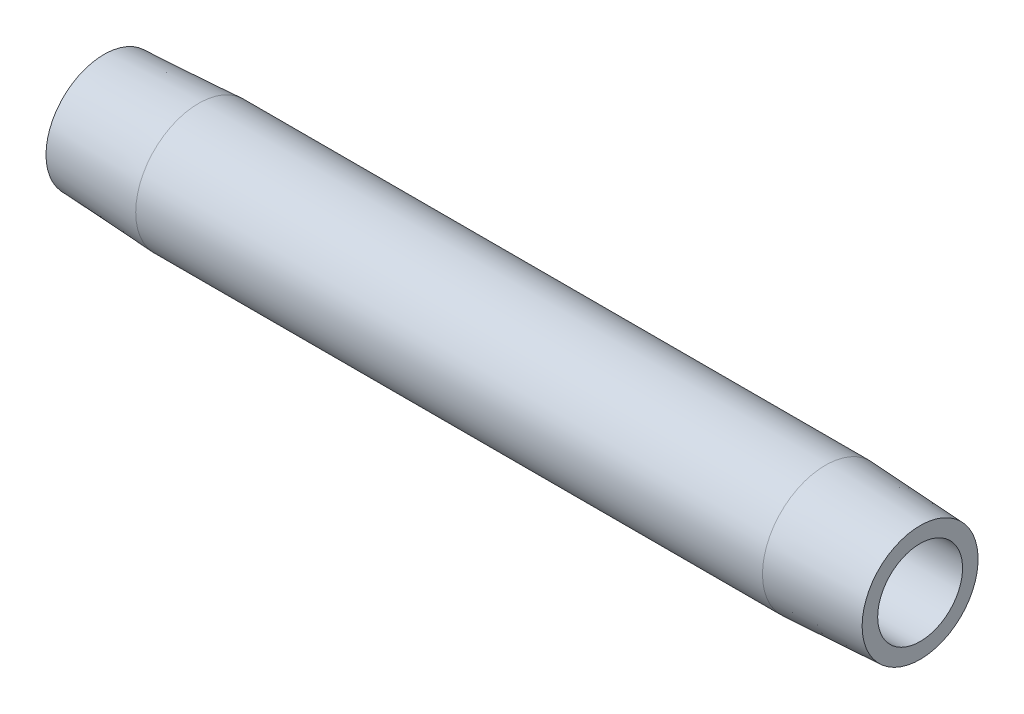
ISO-10303-21;
HEADER;
FILE_DESCRIPTION(('STEP AP214'),'2;1');
FILE_NAME('part.step','',(''),(''),'','','');
FILE_SCHEMA(('AUTOMOTIVE_DESIGN { 1 0 10303 214 1 1 1 1 }'));
ENDSEC;
DATA;
#1=APPLICATION_CONTEXT('core data for automotive mechanical design processes');
#2=APPLICATION_PROTOCOL_DEFINITION('international standard','automotive_design',2000,#1);
#3=PRODUCT_CONTEXT('',#1,'mechanical');
#4=PRODUCT('Part','Part','',(#3));
#5=PRODUCT_RELATED_PRODUCT_CATEGORY('part','',(#4));
#6=PRODUCT_DEFINITION_FORMATION('','',#4);
#7=PRODUCT_DEFINITION_CONTEXT('part definition',#1,'design');
#8=PRODUCT_DEFINITION('design','',#6,#7);
#9=PRODUCT_DEFINITION_SHAPE('','',#8);
#10=(LENGTH_UNIT() NAMED_UNIT(*) SI_UNIT(.MILLI.,.METRE.));
#11=(NAMED_UNIT(*) PLANE_ANGLE_UNIT() SI_UNIT($,.RADIAN.));
#12=(NAMED_UNIT(*) SI_UNIT($,.STERADIAN.) SOLID_ANGLE_UNIT());
#13=UNCERTAINTY_MEASURE_WITH_UNIT(LENGTH_MEASURE(1.E-05),#10,'distance_accuracy_value','');
#14=(GEOMETRIC_REPRESENTATION_CONTEXT(3) GLOBAL_UNCERTAINTY_ASSIGNED_CONTEXT((#13)) GLOBAL_UNIT_ASSIGNED_CONTEXT((#10,
#11,#12)) REPRESENTATION_CONTEXT('',''));
#15=CARTESIAN_POINT('',(0.,0.,0.));
#16=DIRECTION('',(0.,0.,1.));
#17=DIRECTION('',(1.,0.,0.));
#18=AXIS2_PLACEMENT_3D('',#15,#16,#17);
#19=CARTESIAN_POINT('',(88.9,0.,-4.62277681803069));
#20=DIRECTION('',(-1.,0.,0.));
#21=DIRECTION('',(0.,0.,1.));
#22=AXIS2_PLACEMENT_3D('',#19,#20,#21);
#23=PLANE('',#22);
#24=CARTESIAN_POINT('',(88.9,0.,0.));
#25=DIRECTION('',(-1.,0.,0.));
#26=DIRECTION('',(0.,0.,1.));
#27=AXIS2_PLACEMENT_3D('',#24,#25,#26);
#28=CIRCLE('',#27,6.31752683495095);
#29=CARTESIAN_POINT('',(88.9,0.,6.31752683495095));
#30=VERTEX_POINT('',#29);
#31=EDGE_CURVE('E10',#30,#30,#28,.T.);
#32=ORIENTED_EDGE('',*,*,#31,.F.);
#33=EDGE_LOOP('',(#32));
#34=FACE_BOUND('',#33,.T.);
#35=CARTESIAN_POINT('',(88.9,0.,0.));
#36=DIRECTION('',(-1.,0.,0.));
#37=DIRECTION('',(0.,0.,1.));
#38=AXIS2_PLACEMENT_3D('',#35,#36,#37);
#39=CIRCLE('',#38,4.62277681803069);
#40=CARTESIAN_POINT('',(88.9,0.,4.62277681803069));
#41=VERTEX_POINT('',#40);
#42=EDGE_CURVE('E52',#41,#41,#39,.T.);
#43=ORIENTED_EDGE('',*,*,#42,.T.);
#44=EDGE_LOOP('',(#43));
#45=FACE_BOUND('',#44,.T.);
#46=ADVANCED_FACE('F30',(#34,#45),#23,.F.);
#47=CARTESIAN_POINT('',(88.9,0.,0.));
#48=DIRECTION('',(-1.,0.,0.));
#49=DIRECTION('',(0.,0.,1.));
#50=AXIS2_PLACEMENT_3D('',#47,#48,#49);
#51=CONICAL_SURFACE('',#50,6.31752683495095,0.052359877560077);
#52=CARTESIAN_POINT('',(78.5876000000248,0.,0.));
#53=DIRECTION('',(-1.,0.,0.));
#54=DIRECTION('',(0.,0.,1.));
#55=AXIS2_PLACEMENT_3D('',#52,#53,#54);
#56=CIRCLE('',#55,6.85797681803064);
#57=CARTESIAN_POINT('',(78.5876000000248,0.,6.85797681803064));
#58=VERTEX_POINT('',#57);
#59=EDGE_CURVE('E36',#58,#58,#56,.T.);
#60=ORIENTED_EDGE('',*,*,#59,.F.);
#61=EDGE_LOOP('',(#60));
#62=FACE_BOUND('',#61,.T.);
#63=ORIENTED_EDGE('',*,*,#31,.T.);
#64=EDGE_LOOP('',(#63));
#65=FACE_BOUND('',#64,.T.);
#66=ADVANCED_FACE('F77',(#62,#65),#51,.T.);
#67=CARTESIAN_POINT('',(-6.37599469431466,0.,0.));
#68=DIRECTION('',(-1.,0.,0.));
#69=DIRECTION('',(0.,0.,1.));
#70=AXIS2_PLACEMENT_3D('',#67,#68,#69);
#71=CYLINDRICAL_SURFACE('',#70,6.85797681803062);
#72=CARTESIAN_POINT('',(10.3123999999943,0.,0.));
#73=DIRECTION('',(-1.,0.,0.));
#74=DIRECTION('',(0.,0.,1.));
#75=AXIS2_PLACEMENT_3D('',#72,#73,#74);
#76=CIRCLE('',#75,6.8579768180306);
#77=CARTESIAN_POINT('',(10.3123999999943,0.,6.8579768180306));
#78=VERTEX_POINT('',#77);
#79=EDGE_CURVE('E40',#78,#78,#76,.T.);
#80=ORIENTED_EDGE('',*,*,#79,.F.);
#81=EDGE_LOOP('',(#80));
#82=FACE_BOUND('',#81,.T.);
#83=ORIENTED_EDGE('',*,*,#59,.T.);
#84=EDGE_LOOP('',(#83));
#85=FACE_BOUND('',#84,.T.);
#86=ADVANCED_FACE('F72',(#82,#85),#71,.T.);
#87=CARTESIAN_POINT('',(10.3123999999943,0.,0.));
#88=DIRECTION('',(1.,0.,0.));
#89=DIRECTION('',(0.,0.,-1.));
#90=AXIS2_PLACEMENT_3D('',#87,#88,#89);
#91=CONICAL_SURFACE('',#90,6.8579768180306,0.0523598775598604);
#92=CARTESIAN_POINT('',(1.90819582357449E-11,0.,0.));
#93=DIRECTION('',(-1.,0.,0.));
#94=DIRECTION('',(0.,0.,1.));
#95=AXIS2_PLACEMENT_3D('',#92,#93,#94);
#96=CIRCLE('',#95,6.31752683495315);
#97=CARTESIAN_POINT('',(1.90819582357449E-11,0.,6.31752683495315));
#98=VERTEX_POINT('',#97);
#99=EDGE_CURVE('E44',#98,#98,#96,.T.);
#100=ORIENTED_EDGE('',*,*,#99,.F.);
#101=EDGE_LOOP('',(#100));
#102=FACE_BOUND('',#101,.T.);
#103=ORIENTED_EDGE('',*,*,#79,.T.);
#104=EDGE_LOOP('',(#103));
#105=FACE_BOUND('',#104,.T.);
#106=ADVANCED_FACE('F66',(#102,#105),#91,.T.);
#107=CARTESIAN_POINT('',(1.90819582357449E-11,0.,-6.31752683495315));
#108=DIRECTION('',(1.,0.,0.));
#109=DIRECTION('',(0.,0.,-1.));
#110=AXIS2_PLACEMENT_3D('',#107,#108,#109);
#111=PLANE('',#110);
#112=CARTESIAN_POINT('',(1.90819582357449E-11,0.,0.));
#113=DIRECTION('',(-1.,0.,0.));
#114=DIRECTION('',(0.,0.,1.));
#115=AXIS2_PLACEMENT_3D('',#112,#113,#114);
#116=CIRCLE('',#115,4.62277681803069);
#117=CARTESIAN_POINT('',(1.90819582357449E-11,0.,4.62277681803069));
#118=VERTEX_POINT('',#117);
#119=EDGE_CURVE('E49',#118,#118,#116,.T.);
#120=ORIENTED_EDGE('',*,*,#119,.F.);
#121=EDGE_LOOP('',(#120));
#122=FACE_BOUND('',#121,.T.);
#123=ORIENTED_EDGE('',*,*,#99,.T.);
#124=EDGE_LOOP('',(#123));
#125=FACE_BOUND('',#124,.T.);
#126=ADVANCED_FACE('F60',(#122,#125),#111,.F.);
#127=CARTESIAN_POINT('',(-6.37599469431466,0.,0.));
#128=DIRECTION('',(-1.,0.,0.));
#129=DIRECTION('',(0.,0.,1.));
#130=AXIS2_PLACEMENT_3D('',#127,#128,#129);
#131=CYLINDRICAL_SURFACE('',#130,4.62277681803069);
#132=ORIENTED_EDGE('',*,*,#42,.F.);
#133=EDGE_LOOP('',(#132));
#134=FACE_BOUND('',#133,.T.);
#135=ORIENTED_EDGE('',*,*,#119,.T.);
#136=EDGE_LOOP('',(#135));
#137=FACE_BOUND('',#136,.T.);
#138=ADVANCED_FACE('F57',(#134,#137),#131,.F.);
#139=CLOSED_SHELL('',(#46,#66,#86,#106,#126,#138));
#140=MANIFOLD_SOLID_BREP('B2',#139);
#141=ADVANCED_BREP_SHAPE_REPRESENTATION('',(#18,#140),#14);
#142=SHAPE_DEFINITION_REPRESENTATION(#9,#141);
ENDSEC;
END-ISO-10303-21;
